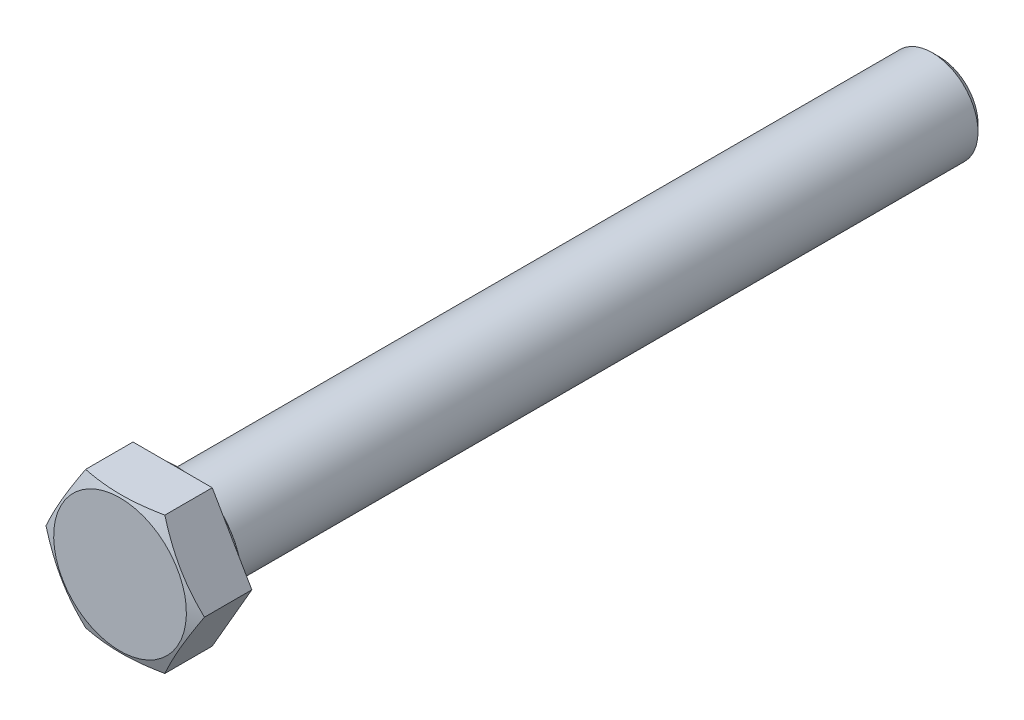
ISO-10303-21;
HEADER;
FILE_DESCRIPTION(('STEP AP214'),'2;1');
FILE_NAME('part.step','',(''),(''),'','','');
FILE_SCHEMA(('AUTOMOTIVE_DESIGN { 1 0 10303 214 1 1 1 1 }'));
ENDSEC;
DATA;
#1=APPLICATION_CONTEXT('core data for automotive mechanical design processes');
#2=APPLICATION_PROTOCOL_DEFINITION('international standard','automotive_design',2000,#1);
#3=PRODUCT_CONTEXT('',#1,'mechanical');
#4=PRODUCT('Part','Part','',(#3));
#5=PRODUCT_RELATED_PRODUCT_CATEGORY('part','',(#4));
#6=PRODUCT_DEFINITION_FORMATION('','',#4);
#7=PRODUCT_DEFINITION_CONTEXT('part definition',#1,'design');
#8=PRODUCT_DEFINITION('design','',#6,#7);
#9=PRODUCT_DEFINITION_SHAPE('','',#8);
#10=(LENGTH_UNIT() NAMED_UNIT(*) SI_UNIT(.MILLI.,.METRE.));
#11=(NAMED_UNIT(*) PLANE_ANGLE_UNIT() SI_UNIT($,.RADIAN.));
#12=(NAMED_UNIT(*) SI_UNIT($,.STERADIAN.) SOLID_ANGLE_UNIT());
#13=UNCERTAINTY_MEASURE_WITH_UNIT(LENGTH_MEASURE(1.E-05),#10,'distance_accuracy_value','');
#14=(GEOMETRIC_REPRESENTATION_CONTEXT(3) GLOBAL_UNCERTAINTY_ASSIGNED_CONTEXT((#13)) GLOBAL_UNIT_ASSIGNED_CONTEXT((#10,
#11,#12)) REPRESENTATION_CONTEXT('',''));
#15=CARTESIAN_POINT('',(0.,0.,0.));
#16=DIRECTION('',(0.,0.,1.));
#17=DIRECTION('',(1.,0.,0.));
#18=AXIS2_PLACEMENT_3D('',#15,#16,#17);
#19=CARTESIAN_POINT('',(0.,2.52640625,-100.));
#20=DIRECTION('',(0.,0.,-1.));
#21=DIRECTION('',(0.,1.,0.));
#22=AXIS2_PLACEMENT_3D('',#19,#20,#21);
#23=PLANE('',#22);
#24=CARTESIAN_POINT('',(0.,0.,-100.));
#25=DIRECTION('',(0.,0.,-1.));
#26=DIRECTION('',(0.,1.,0.));
#27=AXIS2_PLACEMENT_3D('',#24,#25,#26);
#28=CIRCLE('',#27,5.0528125);
#29=CARTESIAN_POINT('',(0.,5.0528125,-100.));
#30=VERTEX_POINT('',#29);
#31=EDGE_CURVE('E11',#30,#30,#28,.T.);
#32=ORIENTED_EDGE('',*,*,#31,.T.);
#33=EDGE_LOOP('',(#32));
#34=FACE_BOUND('',#33,.T.);
#35=ADVANCED_FACE('F16',(#34),#23,.T.);
#36=CARTESIAN_POINT('',(0.,0.,-99.52640625));
#37=DIRECTION('',(0.,0.,1.));
#38=DIRECTION('',(0.,1.,0.));
#39=AXIS2_PLACEMENT_3D('',#36,#37,#38);
#40=CONICAL_SURFACE('',#39,5.52640625,0.785398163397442);
#41=CARTESIAN_POINT('',(0.,0.,-99.0528125));
#42=DIRECTION('',(0.,0.,-1.));
#43=DIRECTION('',(0.,1.,0.));
#44=AXIS2_PLACEMENT_3D('',#41,#42,#43);
#45=CIRCLE('',#44,6.);
#46=CARTESIAN_POINT('',(0.,6.,-99.0528125));
#47=VERTEX_POINT('',#46);
#48=EDGE_CURVE('E20',#47,#47,#45,.T.);
#49=ORIENTED_EDGE('',*,*,#48,.T.);
#50=EDGE_LOOP('',(#49));
#51=FACE_BOUND('',#50,.T.);
#52=ORIENTED_EDGE('',*,*,#31,.F.);
#53=EDGE_LOOP('',(#52));
#54=FACE_BOUND('',#53,.T.);
#55=ADVANCED_FACE('F18',(#51,#54),#40,.T.);
#56=CARTESIAN_POINT('',(0.,0.,-50.40140625));
#57=DIRECTION('',(0.,0.,1.));
#58=DIRECTION('',(0.,1.,0.));
#59=AXIS2_PLACEMENT_3D('',#56,#57,#58);
#60=CYLINDRICAL_SURFACE('',#59,6.);
#61=CARTESIAN_POINT('',(0.,0.,-1.75));
#62=DIRECTION('',(0.,0.,-1.));
#63=DIRECTION('',(0.,1.,0.));
#64=AXIS2_PLACEMENT_3D('',#61,#62,#63);
#65=CIRCLE('',#64,6.);
#66=CARTESIAN_POINT('',(0.,6.,-1.75));
#67=VERTEX_POINT('',#66);
#68=EDGE_CURVE('E144',#67,#67,#65,.T.);
#69=ORIENTED_EDGE('',*,*,#68,.T.);
#70=EDGE_LOOP('',(#69));
#71=FACE_BOUND('',#70,.T.);
#72=ORIENTED_EDGE('',*,*,#48,.F.);
#73=EDGE_LOOP('',(#72));
#74=FACE_BOUND('',#73,.T.);
#75=ADVANCED_FACE('F235',(#71,#74),#60,.T.);
#76=CARTESIAN_POINT('',(0.,5.52640625,-1.75));
#77=DIRECTION('',(0.,0.,1.));
#78=DIRECTION('',(0.,-1.,0.));
#79=AXIS2_PLACEMENT_3D('',#76,#77,#78);
#80=PLANE('',#79);
#81=CARTESIAN_POINT('',(0.,0.,-1.75));
#82=DIRECTION('',(0.,0.,-1.));
#83=DIRECTION('',(0.,1.,0.));
#84=AXIS2_PLACEMENT_3D('',#81,#82,#83);
#85=CIRCLE('',#84,5.0528125);
#86=CARTESIAN_POINT('',(0.,5.0528125,-1.75));
#87=VERTEX_POINT('',#86);
#88=EDGE_CURVE('E88',#87,#87,#85,.T.);
#89=ORIENTED_EDGE('',*,*,#88,.T.);
#90=EDGE_LOOP('',(#89));
#91=FACE_BOUND('',#90,.T.);
#92=ORIENTED_EDGE('',*,*,#68,.F.);
#93=EDGE_LOOP('',(#92));
#94=FACE_BOUND('',#93,.T.);
#95=ADVANCED_FACE('F252',(#91,#94),#80,.T.);
#96=CARTESIAN_POINT('',(0.,0.,-1.47657052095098));
#97=DIRECTION('',(0.,0.,1.));
#98=DIRECTION('',(0.,1.,0.));
#99=AXIS2_PLACEMENT_3D('',#96,#97,#98);
#100=CONICAL_SURFACE('',#99,5.52640625,1.0471975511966);
#101=CARTESIAN_POINT('',(0.,0.,-1.20314104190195));
#102=DIRECTION('',(0.,0.,-1.));
#103=DIRECTION('',(0.,1.,0.));
#104=AXIS2_PLACEMENT_3D('',#101,#102,#103);
#105=CIRCLE('',#104,6.);
#106=CARTESIAN_POINT('',(0.,6.,-1.20314104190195));
#107=VERTEX_POINT('',#106);
#108=EDGE_CURVE('E83',#107,#107,#105,.T.);
#109=ORIENTED_EDGE('',*,*,#108,.T.);
#110=EDGE_LOOP('',(#109));
#111=FACE_BOUND('',#110,.T.);
#112=ORIENTED_EDGE('',*,*,#88,.F.);
#113=EDGE_LOOP('',(#112));
#114=FACE_BOUND('',#113,.T.);
#115=ADVANCED_FACE('F249',(#111,#114),#100,.T.);
#116=CARTESIAN_POINT('',(0.,0.,-0.901570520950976));
#117=DIRECTION('',(0.,0.,1.));
#118=DIRECTION('',(0.,1.,0.));
#119=AXIS2_PLACEMENT_3D('',#116,#117,#118);
#120=CYLINDRICAL_SURFACE('',#119,6.);
#121=CARTESIAN_POINT('',(0.,0.,-0.6));
#122=DIRECTION('',(0.,0.,-1.));
#123=DIRECTION('',(0.,1.,0.));
#124=AXIS2_PLACEMENT_3D('',#121,#122,#123);
#125=CIRCLE('',#124,6.);
#126=CARTESIAN_POINT('',(0.,6.,-0.6));
#127=VERTEX_POINT('',#126);
#128=EDGE_CURVE('E146',#127,#127,#125,.T.);
#129=ORIENTED_EDGE('',*,*,#128,.T.);
#130=EDGE_LOOP('',(#129));
#131=FACE_BOUND('',#130,.T.);
#132=ORIENTED_EDGE('',*,*,#108,.F.);
#133=EDGE_LOOP('',(#132));
#134=FACE_BOUND('',#133,.T.);
#135=ADVANCED_FACE('F239',(#131,#134),#120,.T.);
#136=CARTESIAN_POINT('',(0.,0.,-0.6));
#137=DIRECTION('',(0.,0.,-1.));
#138=DIRECTION('',(-1.,0.,0.));
#139=AXIS2_PLACEMENT_3D('',#136,#137,#138);
#140=TOROIDAL_SURFACE('',#139,6.6,0.6);
#141=CARTESIAN_POINT('',(0.,0.,0.));
#142=DIRECTION('',(0.,0.,-1.));
#143=DIRECTION('',(0.,1.,0.));
#144=AXIS2_PLACEMENT_3D('',#141,#142,#143);
#145=CIRCLE('',#144,6.6);
#146=CARTESIAN_POINT('',(0.,6.6,0.));
#147=VERTEX_POINT('',#146);
#148=EDGE_CURVE('E148',#147,#147,#145,.T.);
#149=ORIENTED_EDGE('',*,*,#148,.T.);
#150=EDGE_LOOP('',(#149));
#151=FACE_BOUND('',#150,.T.);
#152=ORIENTED_EDGE('',*,*,#128,.F.);
#153=EDGE_LOOP('',(#152));
#154=FACE_BOUND('',#153,.T.);
#155=ADVANCED_FACE('F245',(#151,#154),#140,.F.);
#156=CARTESIAN_POINT('',(0.,7.4175,0.));
#157=DIRECTION('',(0.,0.,-1.));
#158=DIRECTION('',(0.,1.,0.));
#159=AXIS2_PLACEMENT_3D('',#156,#157,#158);
#160=PLANE('',#159);
#161=CARTESIAN_POINT('',(0.,0.,0.));
#162=DIRECTION('',(0.,0.,-1.));
#163=DIRECTION('',(0.,1.,0.));
#164=AXIS2_PLACEMENT_3D('',#161,#162,#163);
#165=CIRCLE('',#164,8.235);
#166=CARTESIAN_POINT('',(0.,8.235,0.));
#167=VERTEX_POINT('',#166);
#168=EDGE_CURVE('E131',#167,#167,#165,.T.);
#169=ORIENTED_EDGE('',*,*,#168,.T.);
#170=EDGE_LOOP('',(#169));
#171=FACE_BOUND('',#170,.T.);
#172=ORIENTED_EDGE('',*,*,#148,.F.);
#173=EDGE_LOOP('',(#172));
#174=FACE_BOUND('',#173,.T.);
#175=ADVANCED_FACE('F224',(#171,#174),#160,.T.);
#176=CARTESIAN_POINT('',(0.,0.,0.6));
#177=DIRECTION('',(0.,0.,-1.));
#178=DIRECTION('',(-1.,0.,0.));
#179=AXIS2_PLACEMENT_3D('',#176,#177,#178);
#180=TOROIDAL_SURFACE('',#179,8.235,0.6);
#181=CARTESIAN_POINT('',(0.,0.,0.6));
#182=DIRECTION('',(0.,0.,-1.));
#183=DIRECTION('',(0.,1.,0.));
#184=AXIS2_PLACEMENT_3D('',#181,#182,#183);
#185=CIRCLE('',#184,8.835);
#186=CARTESIAN_POINT('',(0.,8.835,0.6));
#187=VERTEX_POINT('',#186);
#188=EDGE_CURVE('E129',#187,#187,#185,.T.);
#189=ORIENTED_EDGE('',*,*,#188,.T.);
#190=EDGE_LOOP('',(#189));
#191=FACE_BOUND('',#190,.T.);
#192=ORIENTED_EDGE('',*,*,#168,.F.);
#193=EDGE_LOOP('',(#192));
#194=FACE_BOUND('',#193,.T.);
#195=ADVANCED_FACE('F213',(#191,#194),#180,.T.);
#196=CARTESIAN_POINT('',(0.,9.61365,0.6));
#197=DIRECTION('',(0.,0.,-1.));
#198=DIRECTION('',(0.,1.,0.));
#199=AXIS2_PLACEMENT_3D('',#196,#197,#198);
#200=PLANE('',#199);
#201=ORIENTED_EDGE('',*,*,#188,.F.);
#202=EDGE_LOOP('',(#201));
#203=FACE_BOUND('',#202,.T.);
#204=DIRECTION('',(0.5,-0.866025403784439,0.));
#205=VECTOR('',#204,1.);
#206=CARTESIAN_POINT('',(-9.87564128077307,-0.89487915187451,0.599999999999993));
#207=LINE('',#206,#205);
#208=CARTESIAN_POINT('',(-10.3923,0.,0.6));
#209=VERTEX_POINT('',#208);
#210=CARTESIAN_POINT('',(-5.19615,-8.99999580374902,0.6));
#211=VERTEX_POINT('',#210);
#212=EDGE_CURVE('E132',#209,#211,#207,.T.);
#213=ORIENTED_EDGE('',*,*,#212,.F.);
#214=DIRECTION('',(-0.5,-0.866025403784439,0.));
#215=VECTOR('',#214,1.);
#216=CARTESIAN_POINT('',(-5.71280871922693,8.10511665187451,0.6));
#217=LINE('',#216,#215);
#218=CARTESIAN_POINT('',(-5.19615,8.99999580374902,0.6));
#219=VERTEX_POINT('',#218);
#220=EDGE_CURVE('E170',#219,#209,#217,.T.);
#221=ORIENTED_EDGE('',*,*,#220,.F.);
#222=DIRECTION('',(-1.,0.,0.));
#223=VECTOR('',#222,1.);
#224=CARTESIAN_POINT('',(0.,8.99999580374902,0.6));
#225=LINE('',#224,#223);
#226=CARTESIAN_POINT('',(5.19615,8.99999580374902,0.6));
#227=VERTEX_POINT('',#226);
#228=EDGE_CURVE('E136',#227,#219,#225,.T.);
#229=ORIENTED_EDGE('',*,*,#228,.F.);
#230=DIRECTION('',(-0.5,0.866025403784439,0.));
#231=VECTOR('',#230,1.);
#232=CARTESIAN_POINT('',(5.71280871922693,8.10511665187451,0.6));
#233=LINE('',#232,#231);
#234=CARTESIAN_POINT('',(10.3923,0.,0.6));
#235=VERTEX_POINT('',#234);
#236=EDGE_CURVE('E109',#235,#227,#233,.T.);
#237=ORIENTED_EDGE('',*,*,#236,.F.);
#238=DIRECTION('',(0.5,0.866025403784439,0.));
#239=VECTOR('',#238,1.);
#240=CARTESIAN_POINT('',(9.87564128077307,-0.894879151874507,0.6));
#241=LINE('',#240,#239);
#242=CARTESIAN_POINT('',(5.19615,-8.99999580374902,0.6));
#243=VERTEX_POINT('',#242);
#244=EDGE_CURVE('E122',#243,#235,#241,.T.);
#245=ORIENTED_EDGE('',*,*,#244,.F.);
#246=DIRECTION('',(1.,0.,0.));
#247=VECTOR('',#246,1.);
#248=CARTESIAN_POINT('',(0.,-8.99999580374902,0.599999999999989));
#249=LINE('',#248,#247);
#250=EDGE_CURVE('E165',#211,#243,#249,.T.);
#251=ORIENTED_EDGE('',*,*,#250,.F.);
#252=EDGE_LOOP('',(#213,#221,#229,#237,#245,#251));
#253=FACE_BOUND('',#252,.T.);
#254=ADVANCED_FACE('F211',(#203,#253),#200,.T.);
#255=CARTESIAN_POINT('',(0.,0.,7.15909090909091));
#256=DIRECTION('',(0.,0.,-1.));
#257=DIRECTION('',(0.,1.,0.));
#258=AXIS2_PLACEMENT_3D('',#255,#256,#257);
#259=CONICAL_SURFACE('',#258,9.54852039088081,1.18682389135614);
#260=CARTESIAN_POINT('',(0.,0.,7.5));
#261=DIRECTION('',(0.,0.,-1.));
#262=DIRECTION('',(0.,1.,0.));
#263=AXIS2_PLACEMENT_3D('',#260,#261,#262);
#264=CIRCLE('',#263,8.70474078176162);
#265=CARTESIAN_POINT('',(0.,8.70474078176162,7.5));
#266=VERTEX_POINT('',#265);
#267=EDGE_CURVE('E108',#266,#266,#264,.T.);
#268=ORIENTED_EDGE('',*,*,#267,.T.);
#269=EDGE_LOOP('',(#268));
#270=FACE_BOUND('',#269,.T.);
#271=CARTESIAN_POINT('',(5.19615,-8.99999580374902,6.81818181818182));
#272=CARTESIAN_POINT('',(0.,-8.99999580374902,7.8678722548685));
#273=CARTESIAN_POINT('',(-5.19615,-8.99999580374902,6.81818181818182));
#274=(BOUNDED_CURVE() B_SPLINE_CURVE(2,(#271,#272,#273),.UNSPECIFIED.,.F.,
.F.) B_SPLINE_CURVE_WITH_KNOTS((3,3),(0.,10.4530209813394),
.UNSPECIFIED.) CURVE() GEOMETRIC_REPRESENTATION_ITEM() RATIONAL_B_SPLINE_CURVE((1.,
1.15470053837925,1.)) REPRESENTATION_ITEM(''));
#275=CARTESIAN_POINT('',(5.19615,-8.99999580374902,6.81818181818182));
#276=VERTEX_POINT('',#275);
#277=CARTESIAN_POINT('',(-5.19615,-8.99999580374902,6.81818181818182));
#278=VERTEX_POINT('',#277);
#279=EDGE_CURVE('E115',#276,#278,#274,.T.);
#280=ORIENTED_EDGE('',*,*,#279,.F.);
#281=CARTESIAN_POINT('',(10.3923,0.,6.81818181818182));
#282=CARTESIAN_POINT('',(7.794225,-4.49999790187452,7.86787225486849));
#283=CARTESIAN_POINT('',(5.19615,-8.99999580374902,6.81818181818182));
#284=(BOUNDED_CURVE() B_SPLINE_CURVE(2,(#281,#282,#283),.UNSPECIFIED.,.F.,
.F.) B_SPLINE_CURVE_WITH_KNOTS((3,3),(0.,10.4530209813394),
.UNSPECIFIED.) CURVE() GEOMETRIC_REPRESENTATION_ITEM() RATIONAL_B_SPLINE_CURVE((1.,
1.15470053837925,1.)) REPRESENTATION_ITEM(''));
#285=CARTESIAN_POINT('',(10.3923,0.,6.81818181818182));
#286=VERTEX_POINT('',#285);
#287=EDGE_CURVE('E112',#286,#276,#284,.T.);
#288=ORIENTED_EDGE('',*,*,#287,.F.);
#289=CARTESIAN_POINT('',(5.19615,8.99999580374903,6.81818181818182));
#290=CARTESIAN_POINT('',(7.794225,4.49999790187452,7.86787225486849));
#291=CARTESIAN_POINT('',(10.3923,0.,6.81818181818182));
#292=(BOUNDED_CURVE() B_SPLINE_CURVE(2,(#289,#290,#291),.UNSPECIFIED.,.F.,
.F.) B_SPLINE_CURVE_WITH_KNOTS((3,3),(0.,10.4530209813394),
.UNSPECIFIED.) CURVE() GEOMETRIC_REPRESENTATION_ITEM() RATIONAL_B_SPLINE_CURVE((1.,
1.15470053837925,1.)) REPRESENTATION_ITEM(''));
#293=CARTESIAN_POINT('',(5.19615,8.99999580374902,6.81818181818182));
#294=VERTEX_POINT('',#293);
#295=EDGE_CURVE('E97',#294,#286,#292,.T.);
#296=ORIENTED_EDGE('',*,*,#295,.F.);
#297=CARTESIAN_POINT('',(-5.19615,8.99999580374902,6.81818181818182));
#298=CARTESIAN_POINT('',(0.,8.99999580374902,7.8678722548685));
#299=CARTESIAN_POINT('',(5.19615,8.99999580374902,6.81818181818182));
#300=(BOUNDED_CURVE() B_SPLINE_CURVE(2,(#297,#298,#299),.UNSPECIFIED.,.F.,
.F.) B_SPLINE_CURVE_WITH_KNOTS((3,3),(0.,10.4530209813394),
.UNSPECIFIED.) CURVE() GEOMETRIC_REPRESENTATION_ITEM() RATIONAL_B_SPLINE_CURVE((1.,
1.15470053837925,1.)) REPRESENTATION_ITEM(''));
#301=CARTESIAN_POINT('',(-5.19615,8.99999580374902,6.81818181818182));
#302=VERTEX_POINT('',#301);
#303=EDGE_CURVE('E157',#302,#294,#300,.T.);
#304=ORIENTED_EDGE('',*,*,#303,.F.);
#305=CARTESIAN_POINT('',(-10.3923,0.,6.81818181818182));
#306=CARTESIAN_POINT('',(-7.79422499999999,4.49999790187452,7.86787225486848));
#307=CARTESIAN_POINT('',(-5.19615,8.99999580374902,6.81818181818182));
#308=(BOUNDED_CURVE() B_SPLINE_CURVE(2,(#305,#306,#307),.UNSPECIFIED.,.F.,
.F.) B_SPLINE_CURVE_WITH_KNOTS((3,3),(0.,10.4530209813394),
.UNSPECIFIED.) CURVE() GEOMETRIC_REPRESENTATION_ITEM() RATIONAL_B_SPLINE_CURVE((1.,
1.15470053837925,1.)) REPRESENTATION_ITEM(''));
#309=CARTESIAN_POINT('',(-10.3923,0.,6.81818181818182));
#310=VERTEX_POINT('',#309);
#311=EDGE_CURVE('E135',#310,#302,#308,.T.);
#312=ORIENTED_EDGE('',*,*,#311,.F.);
#313=CARTESIAN_POINT('',(-5.19615,-8.99999580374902,6.81818181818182));
#314=CARTESIAN_POINT('',(-7.794225,-4.49999790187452,7.86787225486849));
#315=CARTESIAN_POINT('',(-10.3923,0.,6.81818181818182));
#316=(BOUNDED_CURVE() B_SPLINE_CURVE(2,(#313,#314,#315),.UNSPECIFIED.,.F.,
.F.) B_SPLINE_CURVE_WITH_KNOTS((3,3),(0.,10.4530209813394),
.UNSPECIFIED.) CURVE() GEOMETRIC_REPRESENTATION_ITEM() RATIONAL_B_SPLINE_CURVE((1.,
1.15470053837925,1.)) REPRESENTATION_ITEM(''));
#317=EDGE_CURVE('E152',#278,#310,#316,.T.);
#318=ORIENTED_EDGE('',*,*,#317,.F.);
#319=EDGE_LOOP('',(#280,#288,#296,#304,#312,#318));
#320=FACE_BOUND('',#319,.T.);
#321=ADVANCED_FACE('F113',(#270,#320),#259,.T.);
#322=CARTESIAN_POINT('',(0.,4.35237039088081,7.5));
#323=DIRECTION('',(0.,0.,1.));
#324=DIRECTION('',(0.,-1.,0.));
#325=AXIS2_PLACEMENT_3D('',#322,#323,#324);
#326=PLANE('',#325);
#327=ORIENTED_EDGE('',*,*,#267,.F.);
#328=EDGE_LOOP('',(#327));
#329=FACE_BOUND('',#328,.T.);
#330=ADVANCED_FACE('F221',(#329),#326,.T.);
#331=CARTESIAN_POINT('',(7.794225,4.49999790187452,7.5));
#332=DIRECTION('',(0.866025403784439,0.5,0.));
#333=DIRECTION('',(0.5,-0.866025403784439,0.));
#334=AXIS2_PLACEMENT_3D('',#331,#332,#333);
#335=PLANE('',#334);
#336=ORIENTED_EDGE('',*,*,#236,.T.);
#337=DIRECTION('',(0.,0.,1.));
#338=VECTOR('',#337,1.);
#339=CARTESIAN_POINT('',(5.19615,8.99999580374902,3.70909090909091));
#340=LINE('',#339,#338);
#341=EDGE_CURVE('E104',#227,#294,#340,.T.);
#342=ORIENTED_EDGE('',*,*,#341,.T.);
#343=ORIENTED_EDGE('',*,*,#295,.T.);
#344=DIRECTION('',(0.,0.,1.));
#345=VECTOR('',#344,1.);
#346=CARTESIAN_POINT('',(10.3923,0.,3.70909090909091));
#347=LINE('',#346,#345);
#348=EDGE_CURVE('E101',#235,#286,#347,.T.);
#349=ORIENTED_EDGE('',*,*,#348,.F.);
#350=EDGE_LOOP('',(#336,#342,#343,#349));
#351=FACE_BOUND('',#350,.T.);
#352=ADVANCED_FACE('F99',(#351),#335,.T.);
#353=CARTESIAN_POINT('',(7.794225,-4.49999790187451,7.5));
#354=DIRECTION('',(0.866025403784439,-0.5,0.));
#355=DIRECTION('',(-0.5,-0.866025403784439,0.));
#356=AXIS2_PLACEMENT_3D('',#353,#354,#355);
#357=PLANE('',#356);
#358=ORIENTED_EDGE('',*,*,#244,.T.);
#359=ORIENTED_EDGE('',*,*,#348,.T.);
#360=ORIENTED_EDGE('',*,*,#287,.T.);
#361=DIRECTION('',(0.,0.,1.));
#362=VECTOR('',#361,1.);
#363=CARTESIAN_POINT('',(5.19615,-8.99999580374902,3.70909090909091));
#364=LINE('',#363,#362);
#365=EDGE_CURVE('E167',#243,#276,#364,.T.);
#366=ORIENTED_EDGE('',*,*,#365,.F.);
#367=EDGE_LOOP('',(#358,#359,#360,#366));
#368=FACE_BOUND('',#367,.T.);
#369=ADVANCED_FACE('F120',(#368),#357,.T.);
#370=CARTESIAN_POINT('',(0.,-8.99999580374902,7.5));
#371=DIRECTION('',(0.,-1.,0.));
#372=DIRECTION('',(-1.,0.,0.));
#373=AXIS2_PLACEMENT_3D('',#370,#371,#372);
#374=PLANE('',#373);
#375=ORIENTED_EDGE('',*,*,#250,.T.);
#376=ORIENTED_EDGE('',*,*,#365,.T.);
#377=ORIENTED_EDGE('',*,*,#279,.T.);
#378=DIRECTION('',(0.,0.,1.));
#379=VECTOR('',#378,1.);
#380=CARTESIAN_POINT('',(-5.19615,-8.99999580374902,3.70909090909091));
#381=LINE('',#380,#379);
#382=EDGE_CURVE('E127',#211,#278,#381,.T.);
#383=ORIENTED_EDGE('',*,*,#382,.F.);
#384=EDGE_LOOP('',(#375,#376,#377,#383));
#385=FACE_BOUND('',#384,.T.);
#386=ADVANCED_FACE('F209',(#385),#374,.T.);
#387=CARTESIAN_POINT('',(-7.794225,-4.49999790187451,7.5));
#388=DIRECTION('',(-0.866025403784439,-0.5,0.));
#389=DIRECTION('',(-0.5,0.866025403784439,0.));
#390=AXIS2_PLACEMENT_3D('',#387,#388,#389);
#391=PLANE('',#390);
#392=ORIENTED_EDGE('',*,*,#212,.T.);
#393=ORIENTED_EDGE('',*,*,#382,.T.);
#394=ORIENTED_EDGE('',*,*,#317,.T.);
#395=DIRECTION('',(0.,0.,-1.));
#396=VECTOR('',#395,1.);
#397=CARTESIAN_POINT('',(-10.3923,0.,3.70909090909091));
#398=LINE('',#397,#396);
#399=EDGE_CURVE('E168',#310,#209,#398,.T.);
#400=ORIENTED_EDGE('',*,*,#399,.T.);
#401=EDGE_LOOP('',(#392,#393,#394,#400));
#402=FACE_BOUND('',#401,.T.);
#403=ADVANCED_FACE('F207',(#402),#391,.T.);
#404=CARTESIAN_POINT('',(-7.794225,4.49999790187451,7.5));
#405=DIRECTION('',(-0.866025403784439,0.5,0.));
#406=DIRECTION('',(0.5,0.866025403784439,0.));
#407=AXIS2_PLACEMENT_3D('',#404,#405,#406);
#408=PLANE('',#407);
#409=ORIENTED_EDGE('',*,*,#220,.T.);
#410=ORIENTED_EDGE('',*,*,#399,.F.);
#411=ORIENTED_EDGE('',*,*,#311,.T.);
#412=DIRECTION('',(0.,0.,1.));
#413=VECTOR('',#412,1.);
#414=CARTESIAN_POINT('',(-5.19615,8.99999580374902,3.70909090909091));
#415=LINE('',#414,#413);
#416=EDGE_CURVE('E138',#219,#302,#415,.T.);
#417=ORIENTED_EDGE('',*,*,#416,.F.);
#418=EDGE_LOOP('',(#409,#410,#411,#417));
#419=FACE_BOUND('',#418,.T.);
#420=ADVANCED_FACE('F203',(#419),#408,.T.);
#421=CARTESIAN_POINT('',(0.,8.99999580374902,7.5));
#422=DIRECTION('',(0.,1.,0.));
#423=DIRECTION('',(1.,0.,0.));
#424=AXIS2_PLACEMENT_3D('',#421,#422,#423);
#425=PLANE('',#424);
#426=ORIENTED_EDGE('',*,*,#228,.T.);
#427=ORIENTED_EDGE('',*,*,#416,.T.);
#428=ORIENTED_EDGE('',*,*,#303,.T.);
#429=ORIENTED_EDGE('',*,*,#341,.F.);
#430=EDGE_LOOP('',(#426,#427,#428,#429));
#431=FACE_BOUND('',#430,.T.);
#432=ADVANCED_FACE('F201',(#431),#425,.T.);
#433=CLOSED_SHELL('',(#35,#55,#75,#95,#115,#135,#155,#175,#195,#254,#321,#330,#352,#369,#386,
#403,#420,#432));
#434=MANIFOLD_SOLID_BREP('B1',#433);
#435=ADVANCED_BREP_SHAPE_REPRESENTATION('',(#18,#434),#14);
#436=SHAPE_DEFINITION_REPRESENTATION(#9,#435);
ENDSEC;
END-ISO-10303-21;
